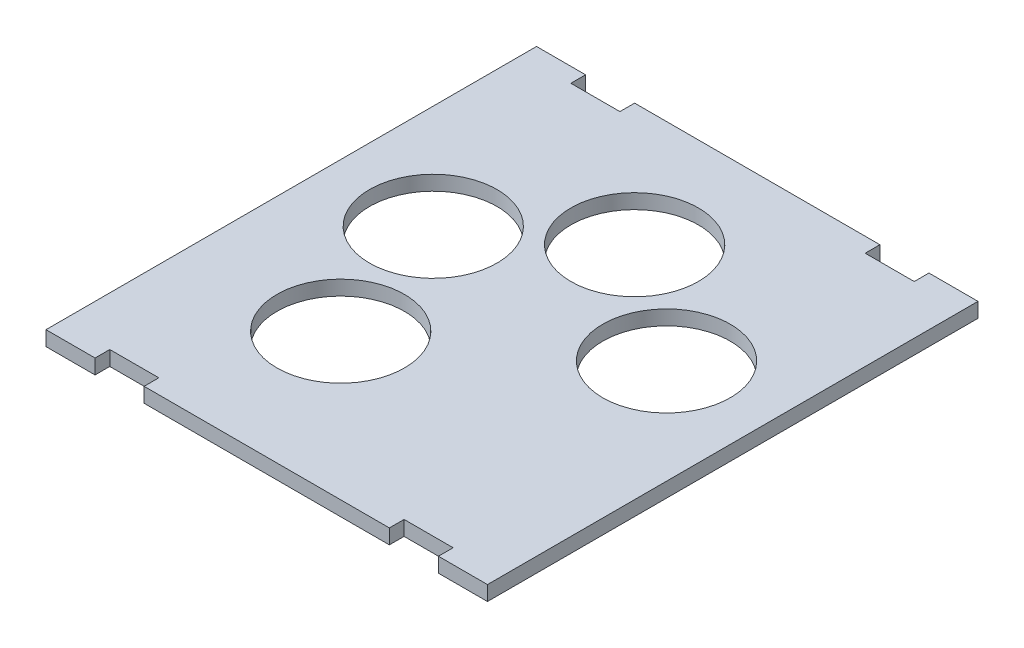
from build123d import *

# Parameters (mm, degrees)
SKETCH_1_W          = 90
SKETCH_1_H          = 100
SKETCH_1_R          = 13
EXTRUDE_1_DEPTH     = 3
SKETCH_2_W          = 10
SKETCH_2_H          = 3
CUT_EXTRUDE_1_DEPTH = 3


with BuildPart() as part:
    # Sketch 1 → Extrude 1 (new body)
    with BuildSketch(Plane(origin=(0, 0, 0), x_dir=(1, 0, 0), z_dir=(0, 1, 0))):
        Rectangle(SKETCH_1_W, SKETCH_1_H)
        with Locations(Location((0, 25, 0), (0, 0, 270))):
            Circle(SKETCH_1_R, mode=Mode.SUBTRACT)
        with Locations(Location((23.776412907, 7.725424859, 0), (0, 0, 270))):
            Circle(SKETCH_1_R, mode=Mode.SUBTRACT)
        with Locations(Location((-14.694631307, -20.225424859, 0), (0, 0, 270))):
            Circle(SKETCH_1_R, mode=Mode.SUBTRACT)
        with Locations(Location((-23.776412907, 7.725424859, 0), (0, 0, 270))):
            Circle(SKETCH_1_R, mode=Mode.SUBTRACT)
    extrude(amount=EXTRUDE_1_DEPTH)

    # Sketch 2 → Cut-Extrude 1 (cut)
    with BuildSketch(Plane(origin=(0, 3, 0), x_dir=(1, 0, 0), z_dir=(0, 1, 0))):
        with Locations((-30, 48.5)):
            Rectangle(SKETCH_2_W, SKETCH_2_H)
        with Locations((30, 48.5)):
            Rectangle(SKETCH_2_W, SKETCH_2_H)
        with Locations((30, -48.5)):
            Rectangle(SKETCH_2_W, SKETCH_2_H)
        with Locations((-30, -48.5)):
            Rectangle(SKETCH_2_W, SKETCH_2_H)
    extrude(amount=-CUT_EXTRUDE_1_DEPTH, mode=Mode.SUBTRACT)


solid = part.part
